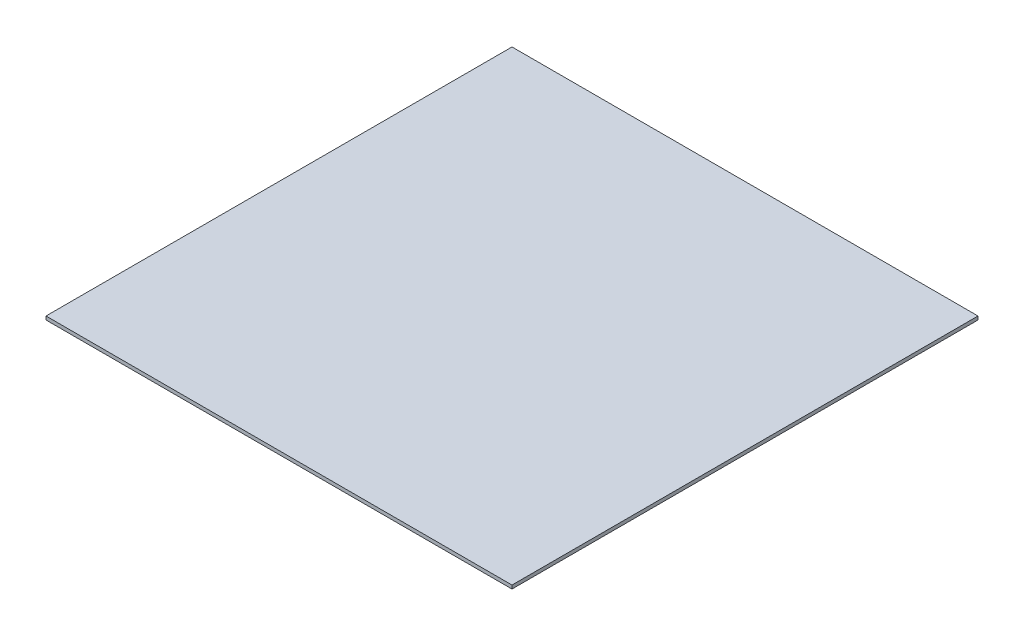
from build123d import *

# Parameters (mm, degrees)
ESQUISSE1_W        = 400
ESQUISSE1_H        = 400
BOSS_EXTRU_1_DEPTH = 3


with BuildPart() as part:
    # Esquisse1 → Boss.-Extru.1 (new body)
    with BuildSketch(Plane(origin=(0, 0, 0), x_dir=(1, 0, 0), z_dir=(0, 1, 0))):
        with Locations((200, 200)):
            Rectangle(ESQUISSE1_W, ESQUISSE1_H)
    extrude(amount=BOSS_EXTRU_1_DEPTH)


solid = part.part
